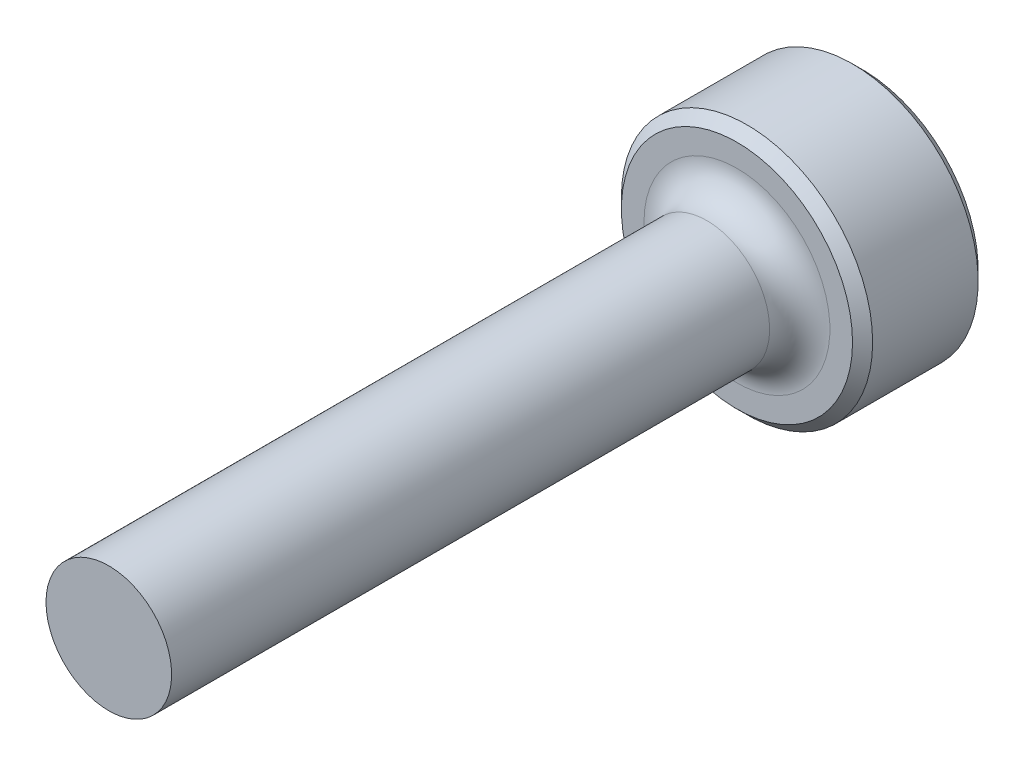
ISO-10303-21;
HEADER;
FILE_DESCRIPTION(('STEP AP214'),'2;1');
FILE_NAME('part.step','',(''),(''),'','','');
FILE_SCHEMA(('AUTOMOTIVE_DESIGN { 1 0 10303 214 1 1 1 1 }'));
ENDSEC;
DATA;
#1=APPLICATION_CONTEXT('core data for automotive mechanical design processes');
#2=APPLICATION_PROTOCOL_DEFINITION('international standard','automotive_design',2000,#1);
#3=PRODUCT_CONTEXT('',#1,'mechanical');
#4=PRODUCT('Part','Part','',(#3));
#5=PRODUCT_RELATED_PRODUCT_CATEGORY('part','',(#4));
#6=PRODUCT_DEFINITION_FORMATION('','',#4);
#7=PRODUCT_DEFINITION_CONTEXT('part definition',#1,'design');
#8=PRODUCT_DEFINITION('design','',#6,#7);
#9=PRODUCT_DEFINITION_SHAPE('','',#8);
#10=(LENGTH_UNIT() NAMED_UNIT(*) SI_UNIT(.MILLI.,.METRE.));
#11=(NAMED_UNIT(*) PLANE_ANGLE_UNIT() SI_UNIT($,.RADIAN.));
#12=(NAMED_UNIT(*) SI_UNIT($,.STERADIAN.) SOLID_ANGLE_UNIT());
#13=UNCERTAINTY_MEASURE_WITH_UNIT(LENGTH_MEASURE(1.E-05),#10,'distance_accuracy_value','');
#14=(GEOMETRIC_REPRESENTATION_CONTEXT(3) GLOBAL_UNCERTAINTY_ASSIGNED_CONTEXT((#13)) GLOBAL_UNIT_ASSIGNED_CONTEXT((#10,
#11,#12)) REPRESENTATION_CONTEXT('',''));
#15=CARTESIAN_POINT('',(0.,0.,0.));
#16=DIRECTION('',(0.,0.,1.));
#17=DIRECTION('',(1.,0.,0.));
#18=AXIS2_PLACEMENT_3D('',#15,#16,#17);
#19=CARTESIAN_POINT('',(0.,1.58749999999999,19.05));
#20=DIRECTION('',(0.,0.,1.));
#21=DIRECTION('',(1.,0.,0.));
#22=AXIS2_PLACEMENT_3D('',#19,#20,#21);
#23=PLANE('',#22);
#24=CARTESIAN_POINT('',(0.,0.,19.05));
#25=DIRECTION('',(0.,0.,-1.));
#26=DIRECTION('',(-1.,0.,0.));
#27=AXIS2_PLACEMENT_3D('',#24,#25,#26);
#28=CIRCLE('',#27,1.58749999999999);
#29=CARTESIAN_POINT('',(-1.58749999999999,0.,19.05));
#30=VERTEX_POINT('',#29);
#31=EDGE_CURVE('E50',#30,#30,#28,.T.);
#32=ORIENTED_EDGE('',*,*,#31,.F.);
#33=EDGE_LOOP('',(#32));
#34=FACE_BOUND('',#33,.T.);
#35=ADVANCED_FACE('F30',(#34),#23,.T.);
#36=CARTESIAN_POINT('',(0.,0.,-25.4347445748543));
#37=DIRECTION('',(0.,0.,-1.));
#38=DIRECTION('',(-1.,0.,0.));
#39=AXIS2_PLACEMENT_3D('',#36,#37,#38);
#40=CYLINDRICAL_SURFACE('',#39,1.5875);
#41=ORIENTED_EDGE('',*,*,#31,.T.);
#42=EDGE_LOOP('',(#41));
#43=FACE_BOUND('',#42,.T.);
#44=CARTESIAN_POINT('',(0.,0.,3.937));
#45=DIRECTION('',(0.,0.,-1.));
#46=DIRECTION('',(-1.,0.,0.));
#47=AXIS2_PLACEMENT_3D('',#44,#45,#46);
#48=CIRCLE('',#47,1.5875);
#49=CARTESIAN_POINT('',(-1.5875,0.,3.937));
#50=VERTEX_POINT('',#49);
#51=EDGE_CURVE('E53',#50,#50,#48,.T.);
#52=ORIENTED_EDGE('',*,*,#51,.F.);
#53=EDGE_LOOP('',(#52));
#54=FACE_BOUND('',#53,.T.);
#55=ADVANCED_FACE('F64',(#43,#54),#40,.T.);
#56=CARTESIAN_POINT('',(0.,0.,3.937));
#57=DIRECTION('',(0.,0.,-1.));
#58=DIRECTION('',(-1.,0.,0.));
#59=AXIS2_PLACEMENT_3D('',#56,#57,#58);
#60=TOROIDAL_SURFACE('',#59,2.3495,0.762);
#61=ORIENTED_EDGE('',*,*,#51,.T.);
#62=EDGE_LOOP('',(#61));
#63=FACE_BOUND('',#62,.T.);
#64=CARTESIAN_POINT('',(0.,0.,3.175));
#65=DIRECTION('',(0.,0.,-1.));
#66=DIRECTION('',(-1.,0.,0.));
#67=AXIS2_PLACEMENT_3D('',#64,#65,#66);
#68=CIRCLE('',#67,2.3495);
#69=CARTESIAN_POINT('',(-2.3495,0.,3.175));
#70=VERTEX_POINT('',#69);
#71=EDGE_CURVE('E56',#70,#70,#68,.T.);
#72=ORIENTED_EDGE('',*,*,#71,.F.);
#73=EDGE_LOOP('',(#72));
#74=FACE_BOUND('',#73,.T.);
#75=ADVANCED_FACE('F62',(#63,#74),#60,.F.);
#76=CARTESIAN_POINT('',(0.,3.175,3.175));
#77=DIRECTION('',(0.,0.,1.));
#78=DIRECTION('',(1.,0.,0.));
#79=AXIS2_PLACEMENT_3D('',#76,#77,#78);
#80=PLANE('',#79);
#81=CARTESIAN_POINT('',(0.,0.,3.175));
#82=DIRECTION('',(0.,0.,1.));
#83=DIRECTION('',(1.,0.,0.));
#84=AXIS2_PLACEMENT_3D('',#81,#82,#83);
#85=CIRCLE('',#84,2.921);
#86=CARTESIAN_POINT('',(2.921,0.,3.175));
#87=VERTEX_POINT('',#86);
#88=EDGE_CURVE('E10',#87,#87,#85,.T.);
#89=ORIENTED_EDGE('',*,*,#88,.T.);
#90=EDGE_LOOP('',(#89));
#91=FACE_BOUND('',#90,.T.);
#92=ORIENTED_EDGE('',*,*,#71,.T.);
#93=EDGE_LOOP('',(#92));
#94=FACE_BOUND('',#93,.T.);
#95=ADVANCED_FACE('F60',(#91,#94),#80,.T.);
#96=CARTESIAN_POINT('',(0.,0.,-25.4347445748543));
#97=DIRECTION('',(0.,0.,-1.));
#98=DIRECTION('',(-1.,0.,0.));
#99=AXIS2_PLACEMENT_3D('',#96,#97,#98);
#100=CYLINDRICAL_SURFACE('',#99,3.175);
#101=CARTESIAN_POINT('',(0.,0.,0.253999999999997));
#102=DIRECTION('',(0.,0.,-1.));
#103=DIRECTION('',(-1.,0.,0.));
#104=AXIS2_PLACEMENT_3D('',#101,#102,#103);
#105=CIRCLE('',#104,3.175);
#106=CARTESIAN_POINT('',(-3.175,0.,0.253999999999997));
#107=VERTEX_POINT('',#106);
#108=EDGE_CURVE('E37',#107,#107,#105,.F.);
#109=ORIENTED_EDGE('',*,*,#108,.T.);
#110=EDGE_LOOP('',(#109));
#111=FACE_BOUND('',#110,.T.);
#112=CARTESIAN_POINT('',(0.,0.,2.921));
#113=DIRECTION('',(0.,0.,1.));
#114=DIRECTION('',(1.,0.,0.));
#115=AXIS2_PLACEMENT_3D('',#112,#113,#114);
#116=CIRCLE('',#115,3.175);
#117=CARTESIAN_POINT('',(3.175,0.,2.921));
#118=VERTEX_POINT('',#117);
#119=EDGE_CURVE('E41',#118,#118,#116,.F.);
#120=ORIENTED_EDGE('',*,*,#119,.T.);
#121=EDGE_LOOP('',(#120));
#122=FACE_BOUND('',#121,.T.);
#123=ADVANCED_FACE('F71',(#111,#122),#100,.T.);
#124=CARTESIAN_POINT('',(0.,0.,0.));
#125=DIRECTION('',(0.,0.,-1.));
#126=DIRECTION('',(-1.,0.,0.));
#127=AXIS2_PLACEMENT_3D('',#124,#125,#126);
#128=PLANE('',#127);
#129=CARTESIAN_POINT('',(0.,0.,0.));
#130=DIRECTION('',(0.,0.,-1.));
#131=DIRECTION('',(-1.,0.,0.));
#132=AXIS2_PLACEMENT_3D('',#129,#130,#131);
#133=CIRCLE('',#132,2.921);
#134=CARTESIAN_POINT('',(-2.921,0.,0.));
#135=VERTEX_POINT('',#134);
#136=EDGE_CURVE('E45',#135,#135,#133,.T.);
#137=ORIENTED_EDGE('',*,*,#136,.T.);
#138=EDGE_LOOP('',(#137));
#139=FACE_BOUND('',#138,.T.);
#140=ADVANCED_FACE('F83',(#139),#128,.T.);
#141=CARTESIAN_POINT('',(0.,0.,0.));
#142=DIRECTION('',(0.,0.,1.));
#143=DIRECTION('',(1.,0.,0.));
#144=AXIS2_PLACEMENT_3D('',#141,#142,#143);
#145=CONICAL_SURFACE('',#144,2.921,0.785398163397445);
#146=ORIENTED_EDGE('',*,*,#108,.F.);
#147=EDGE_LOOP('',(#146));
#148=FACE_BOUND('',#147,.T.);
#149=ORIENTED_EDGE('',*,*,#136,.F.);
#150=EDGE_LOOP('',(#149));
#151=FACE_BOUND('',#150,.T.);
#152=ADVANCED_FACE('F81',(#148,#151),#145,.T.);
#153=CARTESIAN_POINT('',(0.,0.,2.921));
#154=DIRECTION('',(0.,0.,-1.));
#155=DIRECTION('',(-1.,0.,0.));
#156=AXIS2_PLACEMENT_3D('',#153,#154,#155);
#157=CONICAL_SURFACE('',#156,3.175,0.785398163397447);
#158=ORIENTED_EDGE('',*,*,#88,.F.);
#159=EDGE_LOOP('',(#158));
#160=FACE_BOUND('',#159,.T.);
#161=ORIENTED_EDGE('',*,*,#119,.F.);
#162=EDGE_LOOP('',(#161));
#163=FACE_BOUND('',#162,.T.);
#164=ADVANCED_FACE('F32',(#160,#163),#157,.T.);
#165=CLOSED_SHELL('',(#35,#55,#75,#95,#123,#140,#152,#164));
#166=MANIFOLD_SOLID_BREP('B2',#165);
#167=ADVANCED_BREP_SHAPE_REPRESENTATION('',(#18,#166),#14);
#168=SHAPE_DEFINITION_REPRESENTATION(#9,#167);
ENDSEC;
END-ISO-10303-21;
